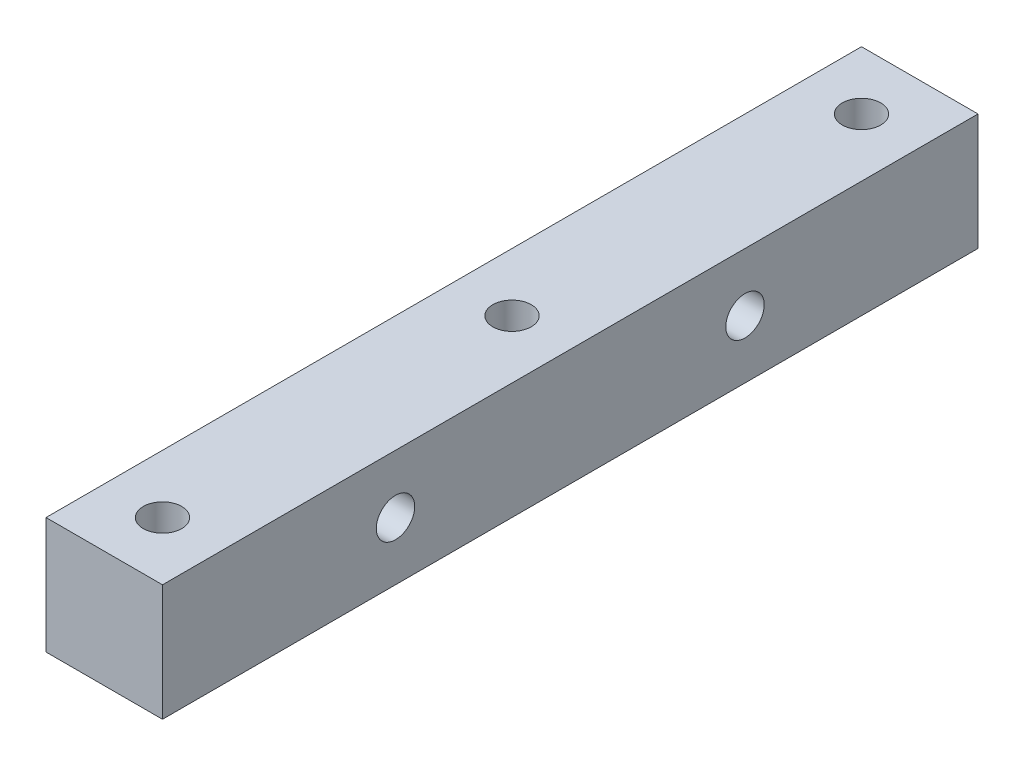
from build123d import *

# Parameters (mm, degrees)
SKETCH_1_W         = 10
SKETCH_1_H         = 10
EXTRUDE_1_DEPTH    = 70
HOLE_WIZARD_M4_1_D = 3.3
HOLE_WIZARD_M4_2_D = 3.3


with BuildPart() as part:
    # Sketch 1 → Extrude 1 (new body)
    with BuildSketch(Plane.XY):
        Rectangle(SKETCH_1_W, SKETCH_1_H)
    extrude(amount=EXTRUDE_1_DEPTH)

    # Hole Wizard M4 _1 (through all)
    with Locations(Plane(origin=(0, 5, 0), x_dir=(1, 0, 0), z_dir=(0, 1, 0))):
        with Locations((0, -5), (0, -35), (0, -65)):
            Hole(HOLE_WIZARD_M4_1_D / 2)

    # Hole Wizard M4 _2 (through all)
    with Locations(Plane(origin=(5, 0, 0), x_dir=(0, 0, -1), z_dir=(1, 0, 0))):
        with Locations((-50, 0), (-20, 0)):
            Hole(HOLE_WIZARD_M4_2_D / 2)


solid = part.part
